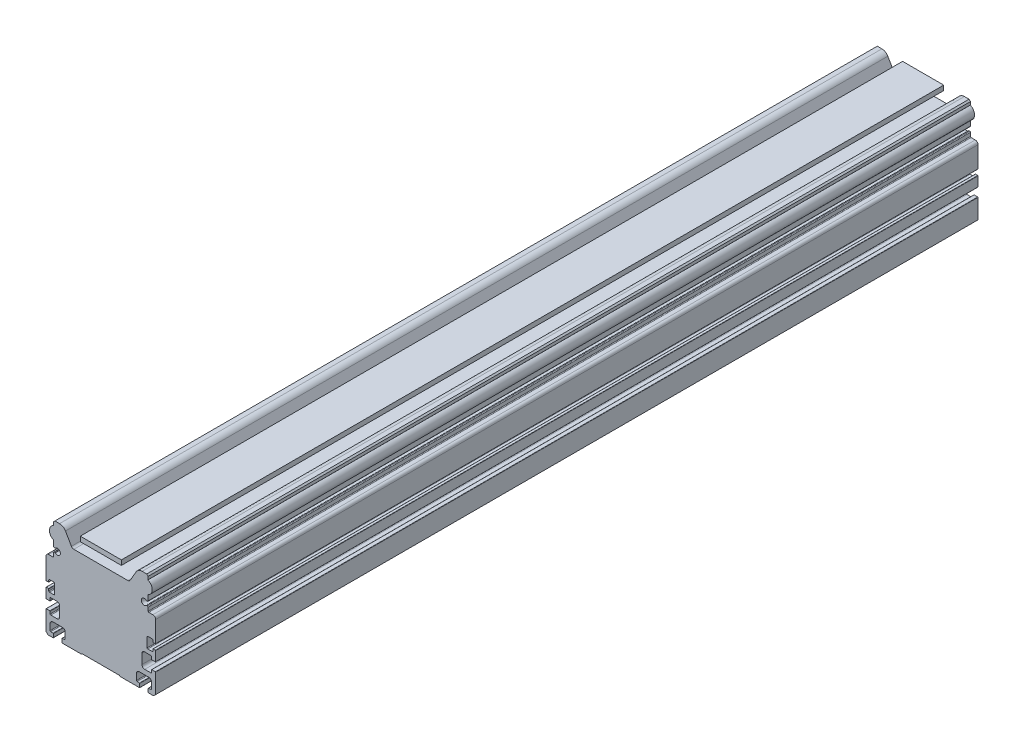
from build123d import *

# Parameters (mm, degrees)
EXTRUDE_1_DEPTH   = 600
SKETCH_1_W        = 30
SKETCH_1_H        = 3.5
EXTRUDE_1_2_DEPTH = 600
EXTRUDE_START     = -600
EXTRUDE_2_DEPTH   = 600


with BuildPart() as part:
    # Sketch 1 → Extrude 1 (new body)
    with BuildSketch(Plane.XY):
        with BuildLine():
            Line((198.888872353, 143.395364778), (159.451333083, 143.395364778))
            ThreePointArc((159.451333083, 143.395364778), (158.451332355, 143.663314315), (157.719281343, 144.395366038))
            Line((157.719281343, 144.395366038), (153.389164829, 151.895355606))
            ThreePointArc((153.389164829, 151.895355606), (151.559037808, 153.725483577), (149.059037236, 154.395357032))
            Line((149.059037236, 154.395357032), (145.670120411, 154.395357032))
            Line((145.670120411, 154.395357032), (144.670103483, 153.395362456))
            Line((144.670103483, 153.395362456), (144.670103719, 151.273884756))
            ThreePointArc((144.670103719, 151.273884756), (144.755749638, 151.109801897), (144.939335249, 151.086249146))
            ThreePointArc((144.939335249, 151.086249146), (141.670115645, 146.395364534), (144.939335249, 141.704479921))
            ThreePointArc((144.939335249, 141.704479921), (144.755749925, 141.68092737), (144.670103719, 141.516845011))
            Line((144.670103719, 141.516845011), (144.670103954, 137.895368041))
            ThreePointArc((144.670103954, 137.895368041), (144.816550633, 137.541813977), (145.170104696, 137.395367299))
            Line((145.170104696, 137.395367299), (145.776000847, 137.395367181))
            ThreePointArc((145.776000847, 137.395367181), (145.852382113, 137.410522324), (145.917186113, 137.453698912))
            ThreePointArc((145.917186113, 137.453698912), (149.670116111, 135.895363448), (145.917185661, 134.337029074))
            ThreePointArc((145.917185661, 134.337029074), (145.852383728, 134.380205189), (145.776004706, 134.395361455))
            Line((145.776004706, 134.395361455), (145.170126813, 134.395361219))
            ThreePointArc((145.170126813, 134.395361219), (144.816572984, 134.248914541), (144.670126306, 133.895360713))
            Line((144.670126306, 133.895360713), (144.670126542, 131.395365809))
            ThreePointArc((144.670126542, 131.395365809), (144.523679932, 131.041811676), (144.170125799, 130.895365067))
            Line((144.170125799, 130.895365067), (141.1701265, 130.895365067))
            ThreePointArc((141.1701265, 130.895365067), (139.755913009, 130.309578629), (139.170126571, 128.895365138))
            Line((139.170126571, 128.895365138), (139.170126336, 113.595368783))
            ThreePointArc((139.170126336, 113.595368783), (139.22870638, 113.453948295), (139.370128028, 113.395371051))
            Line((139.370128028, 113.395371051), (140.970128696, 113.395370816))
            ThreePointArc((140.970128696, 113.395370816), (141.11155058, 113.453948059), (141.170130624, 113.595368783))
            Line((141.170130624, 113.595368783), (141.170130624, 114.895367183))
            ThreePointArc((141.170130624, 114.895367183), (141.316576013, 115.248919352), (141.67012717, 115.395367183))
            Line((141.67012717, 115.395367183), (144.870115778, 115.395367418))
            ThreePointArc((144.870115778, 115.395367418), (145.223666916, 115.248919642), (145.370111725, 114.895367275))
            Line((145.370111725, 114.895367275), (145.370111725, 107.895368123))
            ThreePointArc((145.370111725, 107.895368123), (145.223666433, 107.541815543), (144.870114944, 107.395367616))
            Line((144.870114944, 107.395367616), (141.670126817, 107.395367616))
            ThreePointArc((141.670126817, 107.395367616), (141.316575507, 107.541815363), (141.170130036, 107.895367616))
            Line((141.170130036, 107.895367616), (141.170130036, 109.195369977))
            ThreePointArc((141.170130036, 109.195369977), (141.111551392, 109.336793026), (140.970128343, 109.395371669))
            Line((140.970128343, 109.395371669), (139.370127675, 109.395371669))
            ThreePointArc((139.370127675, 109.395371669), (139.228705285, 109.336793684), (139.170125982, 109.195371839))
            Line((139.170125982, 109.195371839), (139.170125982, 102.195363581))
            ThreePointArc((139.170125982, 102.195363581), (139.228705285, 102.053941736), (139.370127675, 101.995363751))
            Line((139.370127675, 101.995363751), (141.970115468, 101.995363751))
            ThreePointArc((141.970115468, 101.995363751), (142.111538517, 102.053942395), (142.170117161, 102.195365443))
            Line((142.170117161, 102.195365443), (142.170117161, 103.895367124))
            ThreePointArc((142.170117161, 103.895367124), (142.316562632, 104.248919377), (142.670113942, 104.395367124))
            Line((142.670113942, 104.395367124), (147.170113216, 104.395367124))
            ThreePointArc((147.170113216, 104.395367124), (148.584329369, 103.809579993), (149.170116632, 102.395363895))
            Line((149.170116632, 102.395363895), (149.170117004, 95.395363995))
            ThreePointArc((149.170117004, 95.395363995), (148.584329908, 93.981149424), (147.170114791, 93.395363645))
            Line((147.170114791, 93.395363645), (142.670114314, 93.395363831))
            ThreePointArc((142.670114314, 93.395363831), (142.316562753, 93.541811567), (142.170117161, 93.895364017))
            Line((142.170117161, 93.895364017), (142.170117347, 95.595365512))
            ThreePointArc((142.170117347, 95.595365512), (142.111537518, 95.736786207), (141.97011584, 95.795363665))
            Line((141.97011584, 95.795363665), (139.370128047, 95.795363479))
            ThreePointArc((139.370128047, 95.795363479), (139.22870637, 95.736786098), (139.170126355, 95.595365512))
            Line((139.170126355, 95.595365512), (139.170126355, 81.39536254))
            Line((139.170126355, 81.39536254), (140.670125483, 79.895362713))
            Line((140.670125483, 79.895362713), (144.370126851, 79.895362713))
            ThreePointArc((144.370126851, 79.895362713), (144.511549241, 79.953940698), (144.570128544, 80.095362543))
            Line((144.570128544, 80.095362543), (144.570128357, 82.695365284))
            ThreePointArc((144.570128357, 82.695365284), (144.51154905, 82.836787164), (144.370126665, 82.895365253))
            Line((144.370126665, 82.895365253), (142.670114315, 82.895365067))
            ThreePointArc((142.670114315, 82.895365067), (142.316562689, 83.041812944), (142.170117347, 83.39536562))
            Line((142.170117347, 83.39536562), (142.170117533, 87.89536398))
            ThreePointArc((142.170117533, 87.89536398), (142.755904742, 89.309578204), (144.17011956, 89.89536398))
            Line((144.17011956, 89.89536398), (151.170122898, 89.895364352))
            ThreePointArc((151.170122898, 89.895364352), (152.584337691, 89.309578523), (153.170124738, 87.895364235))
            Line((153.170124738, 87.895364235), (153.170124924, 83.39536562))
            ThreePointArc((153.170124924, 83.39536562), (153.023670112, 83.041803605), (152.67010128, 82.895365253))
            Line((152.67010128, 82.895365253), (150.9701157, 82.895365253))
            ThreePointArc((150.9701157, 82.895365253), (150.828693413, 82.836787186), (150.770114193, 82.695365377))
            Line((150.770114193, 82.695365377), (150.770114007, 80.095362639))
            ThreePointArc((150.770114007, 80.095362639), (150.828693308, 79.953940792), (150.9701157, 79.895362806))
            Line((150.9701157, 79.895362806), (165.170120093, 79.895362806))
            Line((165.170120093, 79.895362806), (165.670113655, 80.395363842))
            Line((165.670113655, 80.395363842), (192.670092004, 80.395363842))
            Line((192.670092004, 80.395363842), (193.170085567, 79.895362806))
            Line((193.170085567, 79.895362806), (207.370090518, 79.895362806))
            ThreePointArc((207.370090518, 79.895362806), (207.511512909, 79.953940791), (207.570092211, 80.095362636))
            Line((207.570092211, 80.095362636), (207.570092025, 82.695365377))
            ThreePointArc((207.570092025, 82.695365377), (207.511512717, 82.836787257), (207.370090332, 82.895365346))
            Line((207.370090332, 82.895365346), (205.670104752, 82.89536516))
            ThreePointArc((205.670104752, 82.89536516), (205.316536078, 83.041803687), (205.170081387, 83.395365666))
            Line((205.170081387, 83.395365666), (205.170081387, 87.895364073))
            ThreePointArc((205.170081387, 87.895364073), (205.755868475, 89.309578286), (207.170083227, 89.895364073))
            Line((207.170083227, 89.895364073), (214.170086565, 89.895364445))
            ThreePointArc((214.170086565, 89.895364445), (215.584301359, 89.309578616), (216.170088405, 87.895364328))
            Line((216.170088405, 87.895364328), (216.170088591, 83.395365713))
            ThreePointArc((216.170088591, 83.395365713), (216.023643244, 83.041813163), (215.670091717, 82.895365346))
            Line((215.670091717, 82.895365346), (213.970079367, 82.895365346))
            ThreePointArc((213.970079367, 82.895365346), (213.82865708, 82.836787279), (213.77007786, 82.69536547))
            Line((213.77007786, 82.69536547), (213.770077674, 80.095362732))
            ThreePointArc((213.770077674, 80.095362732), (213.828656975, 79.953940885), (213.970079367, 79.895362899))
            Line((213.970079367, 79.895362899), (217.670080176, 79.895362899))
            Line((217.670080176, 79.895362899), (219.170079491, 81.395362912))
            Line((219.170079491, 81.395362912), (219.170079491, 95.595364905))
            ThreePointArc((219.170079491, 95.595364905), (219.111499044, 95.73678505), (218.970077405, 95.79536189))
            Line((218.970077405, 95.79536189), (216.370089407, 95.795361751))
            ThreePointArc((216.370089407, 95.795361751), (216.228666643, 95.736783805), (216.170087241, 95.595361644))
            Line((216.170087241, 95.595361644), (216.170087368, 93.895362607))
            ThreePointArc((216.170087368, 93.895362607), (216.023642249, 93.541810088), (215.670090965, 93.395361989))
            Line((215.670090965, 93.395361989), (211.170090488, 93.395361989))
            ThreePointArc((211.170090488, 93.395361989), (209.75587582, 93.981147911), (209.170088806, 95.395362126))
            Line((209.170088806, 95.395362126), (209.170087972, 102.395362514))
            ThreePointArc((209.170087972, 102.395362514), (209.755875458, 103.809578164), (211.170091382, 104.395364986))
            Line((211.170091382, 104.395364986), (215.670090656, 104.395365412))
            ThreePointArc((215.670090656, 104.395365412), (216.023642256, 104.248917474), (216.170087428, 103.895364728))
            Line((216.170087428, 103.895364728), (216.170087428, 102.195362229))
            ThreePointArc((216.170087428, 102.195362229), (216.228666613, 102.053940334), (216.370088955, 101.995362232))
            Line((216.370088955, 101.995362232), (218.970076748, 101.995361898))
            ThreePointArc((218.970076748, 101.995361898), (219.111499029, 102.053939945), (219.17007827, 102.195361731))
            Line((219.17007827, 102.195361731), (219.17007827, 109.195369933))
            ThreePointArc((219.17007827, 109.195369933), (219.111499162, 109.336791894), (218.970076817, 109.395370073))
            Line((218.970076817, 109.395370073), (217.370076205, 109.395370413))
            ThreePointArc((217.370076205, 109.395370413), (217.228653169, 109.33679176), (217.170074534, 109.195368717))
            Line((217.170074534, 109.195368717), (217.170074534, 107.895366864))
            ThreePointArc((217.170074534, 107.895366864), (217.023629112, 107.541814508), (216.67007774, 107.395366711))
            Line((216.67007774, 107.395366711), (213.470089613, 107.395366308))
            ThreePointArc((213.470089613, 107.395366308), (213.11653811, 107.541814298), (212.970092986, 107.895366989))
            Line((212.970092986, 107.895366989), (212.970092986, 114.895365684))
            ThreePointArc((212.970092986, 114.895365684), (213.116537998, 115.248918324), (213.470089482, 115.395366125))
            Line((213.470089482, 115.395366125), (216.670077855, 115.395365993))
            ThreePointArc((216.670077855, 115.395365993), (217.023629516, 115.248918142), (217.170074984, 114.895365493))
            Line((217.170074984, 114.895365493), (217.170074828, 113.595367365))
            ThreePointArc((217.170074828, 113.595367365), (217.22865467, 113.453946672), (217.370076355, 113.395369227))
            Line((217.370076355, 113.395369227), (218.970077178, 113.395369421))
            ThreePointArc((218.970077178, 113.395369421), (219.111499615, 113.453946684), (219.170079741, 113.595367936))
            Line((219.170079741, 113.595367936), (219.170079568, 128.895364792))
            ThreePointArc((219.170079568, 128.895364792), (218.58429313, 130.309578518), (217.170079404, 130.895364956))
            Line((217.170079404, 130.895364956), (214.170080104, 130.895364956))
            ThreePointArc((214.170080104, 130.895364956), (213.816526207, 131.041811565), (213.670079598, 131.395365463))
            Line((213.670079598, 131.395365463), (213.670079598, 133.895360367))
            ThreePointArc((213.670079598, 133.895360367), (213.523632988, 134.248914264), (213.170079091, 134.395360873))
            Line((213.170079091, 134.395360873), (212.564201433, 134.395360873))
            ThreePointArc((212.564201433, 134.395360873), (212.487822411, 134.380204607), (212.423020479, 134.337028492))
            ThreePointArc((212.423020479, 134.337028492), (208.670090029, 135.895362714), (212.42301981, 137.453698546))
            ThreePointArc((212.42301981, 137.453698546), (212.487823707, 137.41052208), (212.564204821, 137.395366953))
            Line((212.564204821, 137.395366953), (213.170101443, 137.395366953))
            ThreePointArc((213.170101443, 137.395366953), (213.52365534, 137.541813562), (213.670101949, 137.895367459))
            Line((213.670101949, 137.895367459), (213.670101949, 141.516843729))
            ThreePointArc((213.670101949, 141.516843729), (213.58445613, 141.680926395), (213.400870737, 141.704479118))
            ThreePointArc((213.400870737, 141.704479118), (216.670090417, 146.395364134), (213.400870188, 151.086248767))
            ThreePointArc((213.400870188, 151.086248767), (213.584456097, 151.109801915), (213.670101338, 151.273885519))
            Line((213.670101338, 151.273885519), (213.670101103, 153.395363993))
            Line((213.670101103, 153.395363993), (212.670083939, 154.395358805))
            Line((212.670083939, 154.395358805), (209.281168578, 154.395359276))
            ThreePointArc((209.281168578, 154.395359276), (206.781167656, 153.725485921), (204.951040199, 151.895357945))
            Line((204.951040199, 151.895357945), (200.620923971, 144.395366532))
            ThreePointArc((200.620923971, 144.395366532), (199.888873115, 143.663314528), (198.888872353, 143.395364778))
        make_face()
        with BuildLine():
            ThreePointArc((149.295590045, 142.140146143), (150.205649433, 142.859830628), (150.925333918, 143.769890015))
            ThreePointArc((150.925333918, 143.769890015), (150.896375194, 143.646641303), (150.947227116, 143.530697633))
            ThreePointArc((150.947227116, 143.530697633), (150.912756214, 142.152723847), (149.534782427, 142.118252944))
            ThreePointArc((149.534782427, 142.118252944), (149.418838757, 142.169104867), (149.295590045, 142.140146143))
        make_face(mode=Mode.SUBTRACT)
        with BuildLine():
            ThreePointArc((207.414872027, 143.769889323), (208.134556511, 142.859829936), (209.044615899, 142.140145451))
            ThreePointArc((209.044615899, 142.140145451), (208.921367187, 142.169104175), (208.805423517, 142.118252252))
            ThreePointArc((208.805423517, 142.118252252), (207.392978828, 142.118252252), (207.392978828, 143.530696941))
            ThreePointArc((207.392978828, 143.530696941), (207.443830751, 143.646640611), (207.414872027, 143.769889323))
        make_face(mode=Mode.SUBTRACT)
    extrude(amount=EXTRUDE_1_DEPTH)

    # Sketch 2 → Extrude 2 (add)
    with BuildSketch(Plane.XY.offset(600).offset(EXTRUDE_START)):
        with BuildLine():
            Line((157.719281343, 144.395366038), (153.389164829, 151.895355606))
            ThreePointArc((153.389164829, 151.895355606), (151.559037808, 153.725483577), (149.059037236, 154.395357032))
            Line((149.059037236, 154.395357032), (145.670120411, 154.395357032))
            Line((145.670120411, 154.395357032), (144.670103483, 153.395362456))
            Line((144.670103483, 153.395362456), (144.670103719, 151.273884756))
            ThreePointArc((144.670103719, 151.273884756), (144.755749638, 151.109801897), (144.939335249, 151.086249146))
            ThreePointArc((144.939335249, 151.086249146), (141.670115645, 146.395364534), (144.939335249, 141.704479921))
            ThreePointArc((144.939335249, 141.704479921), (144.755749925, 141.68092737), (144.670103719, 141.516845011))
            Line((144.670103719, 141.516845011), (144.670103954, 137.895368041))
            ThreePointArc((144.670103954, 137.895368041), (144.816550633, 137.541813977), (145.170104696, 137.395367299))
            Line((145.170104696, 137.395367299), (145.776000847, 137.395367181))
            ThreePointArc((145.776000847, 137.395367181), (145.852382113, 137.410522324), (145.917186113, 137.453698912))
            ThreePointArc((145.917186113, 137.453698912), (149.670116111, 135.895363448), (145.917185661, 134.337029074))
            ThreePointArc((145.917185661, 134.337029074), (145.852383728, 134.380205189), (145.776004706, 134.395361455))
            Line((145.776004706, 134.395361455), (145.170126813, 134.395361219))
            ThreePointArc((145.170126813, 134.395361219), (144.816572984, 134.248914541), (144.670126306, 133.895360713))
            Line((144.670126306, 133.895360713), (144.670126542, 131.395365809))
            ThreePointArc((144.670126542, 131.395365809), (144.523679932, 131.041811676), (144.170125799, 130.895365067))
            Line((144.170125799, 130.895365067), (141.1701265, 130.895365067))
            ThreePointArc((141.1701265, 130.895365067), (139.755913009, 130.309578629), (139.170126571, 128.895365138))
            Line((139.170126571, 128.895365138), (139.170126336, 113.595368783))
            ThreePointArc((139.170126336, 113.595368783), (139.22870638, 113.453948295), (139.370128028, 113.395371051))
            Line((139.370128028, 113.395371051), (140.970128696, 113.395370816))
            ThreePointArc((140.970128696, 113.395370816), (141.11155058, 113.453948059), (141.170130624, 113.595368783))
            Line((141.170130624, 113.595368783), (141.170130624, 114.895367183))
            ThreePointArc((141.170130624, 114.895367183), (141.316576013, 115.248919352), (141.67012717, 115.395367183))
            Line((141.67012717, 115.395367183), (144.870115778, 115.395367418))
            ThreePointArc((144.870115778, 115.395367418), (145.223666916, 115.248919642), (145.370111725, 114.895367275))
            Line((145.370111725, 114.895367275), (145.370111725, 107.895368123))
            ThreePointArc((145.370111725, 107.895368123), (145.223666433, 107.541815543), (144.870114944, 107.395367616))
            Line((144.870114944, 107.395367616), (141.670126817, 107.395367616))
            ThreePointArc((141.670126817, 107.395367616), (141.316575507, 107.541815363), (141.170130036, 107.895367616))
            Line((141.170130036, 107.895367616), (141.170130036, 109.195369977))
            ThreePointArc((141.170130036, 109.195369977), (141.111551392, 109.336793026), (140.970128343, 109.395371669))
            Line((140.970128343, 109.395371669), (139.370127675, 109.395371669))
            ThreePointArc((139.370127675, 109.395371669), (139.228705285, 109.336793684), (139.170125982, 109.195371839))
            Line((139.170125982, 109.195371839), (139.170125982, 102.195363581))
            ThreePointArc((139.170125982, 102.195363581), (139.228705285, 102.053941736), (139.370127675, 101.995363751))
            Line((139.370127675, 101.995363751), (141.970115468, 101.995363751))
            ThreePointArc((141.970115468, 101.995363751), (142.111538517, 102.053942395), (142.170117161, 102.195365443))
            Line((142.170117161, 102.195365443), (142.170117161, 103.895367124))
            ThreePointArc((142.170117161, 103.895367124), (142.316562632, 104.248919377), (142.670113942, 104.395367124))
            Line((142.670113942, 104.395367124), (147.170113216, 104.395367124))
            ThreePointArc((147.170113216, 104.395367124), (148.584329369, 103.809579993), (149.170116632, 102.395363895))
            Line((149.170116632, 102.395363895), (149.170117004, 95.395363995))
            ThreePointArc((149.170117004, 95.395363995), (148.584329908, 93.981149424), (147.170114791, 93.395363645))
            Line((147.170114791, 93.395363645), (142.670114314, 93.395363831))
            ThreePointArc((142.670114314, 93.395363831), (142.316562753, 93.541811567), (142.170117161, 93.895364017))
            Line((142.170117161, 93.895364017), (142.170117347, 95.595365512))
            ThreePointArc((142.170117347, 95.595365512), (142.111537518, 95.736786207), (141.97011584, 95.795363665))
            Line((141.97011584, 95.795363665), (139.370128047, 95.795363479))
            ThreePointArc((139.370128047, 95.795363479), (139.22870637, 95.736786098), (139.170126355, 95.595365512))
            Line((139.170126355, 95.595365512), (139.170126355, 81.39536254))
            Line((139.170126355, 81.39536254), (140.670125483, 79.895362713))
            Line((140.670125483, 79.895362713), (144.370126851, 79.895362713))
            ThreePointArc((144.370126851, 79.895362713), (144.511549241, 79.953940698), (144.570128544, 80.095362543))
            Line((144.570128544, 80.095362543), (144.570128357, 82.695365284))
            ThreePointArc((144.570128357, 82.695365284), (144.51154905, 82.836787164), (144.370126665, 82.895365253))
            Line((144.370126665, 82.895365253), (142.670114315, 82.895365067))
            ThreePointArc((142.670114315, 82.895365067), (142.316562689, 83.041812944), (142.170117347, 83.39536562))
            Line((142.170117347, 83.39536562), (142.170117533, 87.89536398))
            ThreePointArc((142.170117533, 87.89536398), (142.755904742, 89.309578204), (144.17011956, 89.89536398))
            Line((144.17011956, 89.89536398), (151.170122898, 89.895364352))
            ThreePointArc((151.170122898, 89.895364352), (152.584337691, 89.309578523), (153.170124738, 87.895364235))
            Line((153.170124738, 87.895364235), (153.170124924, 83.39536562))
            ThreePointArc((153.170124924, 83.39536562), (153.023670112, 83.041803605), (152.67010128, 82.895365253))
            Line((152.67010128, 82.895365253), (150.9701157, 82.895365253))
            ThreePointArc((150.9701157, 82.895365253), (150.828693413, 82.836787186), (150.770114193, 82.695365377))
            Line((150.770114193, 82.695365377), (150.770114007, 80.095362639))
            ThreePointArc((150.770114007, 80.095362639), (150.828693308, 79.953940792), (150.9701157, 79.895362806))
            Line((150.9701157, 79.895362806), (165.170120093, 79.895362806))
            Line((165.170120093, 79.895362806), (165.670113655, 80.395363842))
            Line((165.670113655, 80.395363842), (192.670092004, 80.395363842))
            Line((192.670092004, 80.395363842), (193.170085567, 79.895362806))
            Line((193.170085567, 79.895362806), (207.370090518, 79.895362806))
            ThreePointArc((207.370090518, 79.895362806), (207.511512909, 79.953940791), (207.570092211, 80.095362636))
            Line((207.570092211, 80.095362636), (207.570092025, 82.695365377))
            ThreePointArc((207.570092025, 82.695365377), (207.511512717, 82.836787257), (207.370090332, 82.895365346))
            Line((207.370090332, 82.895365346), (205.670104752, 82.89536516))
            ThreePointArc((205.670104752, 82.89536516), (205.316536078, 83.041803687), (205.170081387, 83.395365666))
            Line((205.170081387, 83.395365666), (205.170081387, 87.895364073))
            ThreePointArc((205.170081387, 87.895364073), (205.755868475, 89.309578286), (207.170083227, 89.895364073))
            Line((207.170083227, 89.895364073), (214.170086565, 89.895364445))
            ThreePointArc((214.170086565, 89.895364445), (215.584301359, 89.309578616), (216.170088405, 87.895364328))
            Line((216.170088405, 87.895364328), (216.170088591, 83.395365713))
            ThreePointArc((216.170088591, 83.395365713), (216.023643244, 83.041813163), (215.670091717, 82.895365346))
            Line((215.670091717, 82.895365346), (213.970079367, 82.895365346))
            ThreePointArc((213.970079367, 82.895365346), (213.82865708, 82.836787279), (213.77007786, 82.69536547))
            Line((213.77007786, 82.69536547), (213.770077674, 80.095362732))
            ThreePointArc((213.770077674, 80.095362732), (213.828656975, 79.953940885), (213.970079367, 79.895362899))
            Line((213.970079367, 79.895362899), (217.670080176, 79.895362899))
            Line((217.670080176, 79.895362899), (219.170079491, 81.395362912))
            Line((219.170079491, 81.395362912), (219.170079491, 95.595364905))
            ThreePointArc((219.170079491, 95.595364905), (219.111499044, 95.73678505), (218.970077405, 95.79536189))
            Line((218.970077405, 95.79536189), (216.370089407, 95.795361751))
            ThreePointArc((216.370089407, 95.795361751), (216.228666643, 95.736783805), (216.170087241, 95.595361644))
            Line((216.170087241, 95.595361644), (216.170087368, 93.895362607))
            ThreePointArc((216.170087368, 93.895362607), (216.023642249, 93.541810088), (215.670090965, 93.395361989))
            Line((215.670090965, 93.395361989), (211.170090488, 93.395361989))
            ThreePointArc((211.170090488, 93.395361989), (209.75587582, 93.981147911), (209.170088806, 95.395362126))
            Line((209.170088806, 95.395362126), (209.170087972, 102.395362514))
            ThreePointArc((209.170087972, 102.395362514), (209.755875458, 103.809578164), (211.170091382, 104.395364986))
            Line((211.170091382, 104.395364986), (215.670090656, 104.395365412))
            ThreePointArc((215.670090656, 104.395365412), (216.023642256, 104.248917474), (216.170087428, 103.895364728))
            Line((216.170087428, 103.895364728), (216.170087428, 102.195362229))
            ThreePointArc((216.170087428, 102.195362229), (216.228666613, 102.053940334), (216.370088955, 101.995362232))
            Line((216.370088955, 101.995362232), (218.970076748, 101.995361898))
            ThreePointArc((218.970076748, 101.995361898), (219.111499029, 102.053939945), (219.17007827, 102.195361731))
            Line((219.17007827, 102.195361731), (219.17007827, 109.195369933))
            ThreePointArc((219.17007827, 109.195369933), (219.111499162, 109.336791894), (218.970076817, 109.395370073))
            Line((218.970076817, 109.395370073), (217.370076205, 109.395370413))
            ThreePointArc((217.370076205, 109.395370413), (217.228653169, 109.33679176), (217.170074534, 109.195368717))
            Line((217.170074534, 109.195368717), (217.170074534, 107.895366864))
            ThreePointArc((217.170074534, 107.895366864), (217.023629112, 107.541814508), (216.67007774, 107.395366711))
            Line((216.67007774, 107.395366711), (213.470089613, 107.395366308))
            ThreePointArc((213.470089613, 107.395366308), (213.11653811, 107.541814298), (212.970092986, 107.895366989))
            Line((212.970092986, 107.895366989), (212.970092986, 114.895365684))
            ThreePointArc((212.970092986, 114.895365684), (213.116537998, 115.248918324), (213.470089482, 115.395366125))
            Line((213.470089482, 115.395366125), (216.670077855, 115.395365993))
            ThreePointArc((216.670077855, 115.395365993), (217.023629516, 115.248918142), (217.170074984, 114.895365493))
            Line((217.170074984, 114.895365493), (217.170074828, 113.595367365))
            ThreePointArc((217.170074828, 113.595367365), (217.22865467, 113.453946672), (217.370076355, 113.395369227))
            Line((217.370076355, 113.395369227), (218.970077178, 113.395369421))
            ThreePointArc((218.970077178, 113.395369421), (219.111499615, 113.453946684), (219.170079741, 113.595367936))
            Line((219.170079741, 113.595367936), (219.170079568, 128.895364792))
            ThreePointArc((219.170079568, 128.895364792), (218.58429313, 130.309578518), (217.170079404, 130.895364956))
            Line((217.170079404, 130.895364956), (214.170080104, 130.895364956))
            ThreePointArc((214.170080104, 130.895364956), (213.816526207, 131.041811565), (213.670079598, 131.395365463))
            Line((213.670079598, 131.395365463), (213.670079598, 133.895360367))
            ThreePointArc((213.670079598, 133.895360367), (213.523632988, 134.248914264), (213.170079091, 134.395360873))
            Line((213.170079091, 134.395360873), (212.564201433, 134.395360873))
            ThreePointArc((212.564201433, 134.395360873), (212.487822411, 134.380204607), (212.423020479, 134.337028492))
            ThreePointArc((212.423020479, 134.337028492), (208.670090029, 135.895362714), (212.42301981, 137.453698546))
            ThreePointArc((212.42301981, 137.453698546), (212.487823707, 137.41052208), (212.564204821, 137.395366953))
            Line((212.564204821, 137.395366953), (213.170101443, 137.395366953))
            ThreePointArc((213.170101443, 137.395366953), (213.52365534, 137.541813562), (213.670101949, 137.895367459))
            Line((213.670101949, 137.895367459), (213.670101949, 141.516843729))
            ThreePointArc((213.670101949, 141.516843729), (213.58445613, 141.680926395), (213.400870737, 141.704479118))
            ThreePointArc((213.400870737, 141.704479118), (216.670090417, 146.395364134), (213.400870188, 151.086248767))
            ThreePointArc((213.400870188, 151.086248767), (213.584456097, 151.109801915), (213.670101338, 151.273885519))
            Line((213.670101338, 151.273885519), (213.670101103, 153.395363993))
            Line((213.670101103, 153.395363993), (212.670083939, 154.395358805))
            Line((212.670083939, 154.395358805), (209.281168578, 154.395359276))
            ThreePointArc((209.281168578, 154.395359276), (206.781167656, 153.725485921), (204.951040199, 151.895357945))
            Line((204.951040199, 151.895357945), (200.620923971, 144.395366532))
            ThreePointArc((200.620923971, 144.395366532), (199.888873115, 143.663314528), (198.888872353, 143.395364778))
            Line((198.888872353, 143.395364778), (159.451333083, 143.395364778))
            ThreePointArc((159.451333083, 143.395364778), (158.451332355, 143.663314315), (157.719281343, 144.395366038))
        make_face()
    extrude(amount=EXTRUDE_2_DEPTH)


with BuildPart() as body_2:
    # Sketch 1 → Extrude 1 2 (new body)
    with BuildSketch(Plane.XY):
        with Locations((179.170103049, 152.29536272)):
            Rectangle(SKETCH_1_W, SKETCH_1_H)
    extrude(amount=EXTRUDE_1_2_DEPTH)


solid = Compound([part.part, body_2.part])
